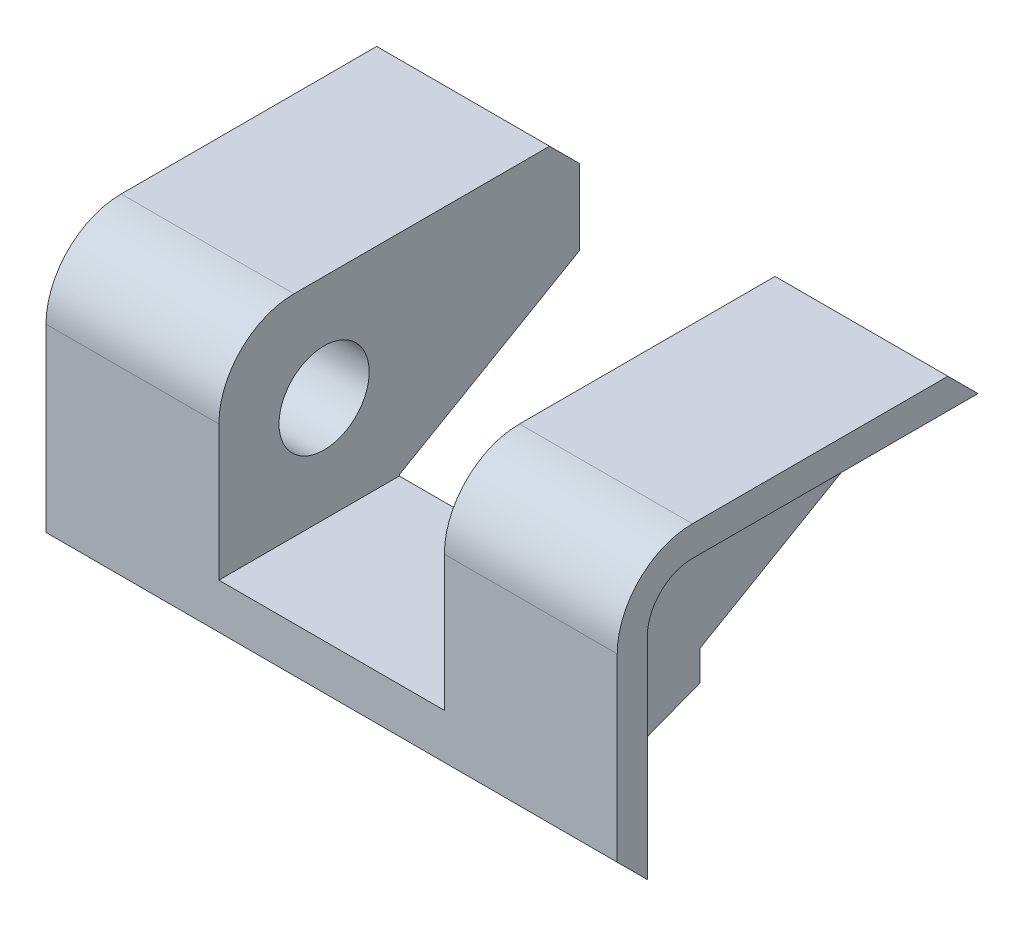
ISO-10303-21;
HEADER;
FILE_DESCRIPTION(('STEP AP214'),'2;1');
FILE_NAME('part.step','',(''),(''),'','','');
FILE_SCHEMA(('AUTOMOTIVE_DESIGN { 1 0 10303 214 1 1 1 1 }'));
ENDSEC;
DATA;
#1=APPLICATION_CONTEXT('core data for automotive mechanical design processes');
#2=APPLICATION_PROTOCOL_DEFINITION('international standard','automotive_design',2000,#1);
#3=PRODUCT_CONTEXT('',#1,'mechanical');
#4=PRODUCT('Part','Part','',(#3));
#5=PRODUCT_RELATED_PRODUCT_CATEGORY('part','',(#4));
#6=PRODUCT_DEFINITION_FORMATION('','',#4);
#7=PRODUCT_DEFINITION_CONTEXT('part definition',#1,'design');
#8=PRODUCT_DEFINITION('design','',#6,#7);
#9=PRODUCT_DEFINITION_SHAPE('','',#8);
#10=(LENGTH_UNIT() NAMED_UNIT(*) SI_UNIT(.MILLI.,.METRE.));
#11=(NAMED_UNIT(*) PLANE_ANGLE_UNIT() SI_UNIT($,.RADIAN.));
#12=(NAMED_UNIT(*) SI_UNIT($,.STERADIAN.) SOLID_ANGLE_UNIT());
#13=UNCERTAINTY_MEASURE_WITH_UNIT(LENGTH_MEASURE(1.E-05),#10,'distance_accuracy_value','');
#14=(GEOMETRIC_REPRESENTATION_CONTEXT(3) GLOBAL_UNCERTAINTY_ASSIGNED_CONTEXT((#13)) GLOBAL_UNIT_ASSIGNED_CONTEXT((#10,
#11,#12)) REPRESENTATION_CONTEXT('',''));
#15=CARTESIAN_POINT('',(0.,0.,0.));
#16=DIRECTION('',(0.,0.,1.));
#17=DIRECTION('',(1.,0.,0.));
#18=AXIS2_PLACEMENT_3D('',#15,#16,#17);
#19=CARTESIAN_POINT('',(-19.,7.,-17.));
#20=DIRECTION('',(0.,0.,1.));
#21=DIRECTION('',(1.,0.,0.));
#22=AXIS2_PLACEMENT_3D('',#19,#20,#21);
#23=PLANE('',#22);
#24=DIRECTION('',(0.,1.,0.));
#25=VECTOR('',#24,1.);
#26=CARTESIAN_POINT('',(-7.5,-7.,-17.));
#27=LINE('',#26,#25);
#28=CARTESIAN_POINT('',(-7.5,0.,-17.));
#29=VERTEX_POINT('',#28);
#30=CARTESIAN_POINT('',(-7.5,5.,-17.));
#31=VERTEX_POINT('',#30);
#32=EDGE_CURVE('E192',#29,#31,#27,.T.);
#33=ORIENTED_EDGE('',*,*,#32,.F.);
#34=DIRECTION('',(1.,0.,0.));
#35=VECTOR('',#34,1.);
#36=CARTESIAN_POINT('',(-19.,0.,-17.));
#37=LINE('',#36,#35);
#38=CARTESIAN_POINT('',(-12.5,0.,-17.));
#39=VERTEX_POINT('',#38);
#40=EDGE_CURVE('E352',#39,#29,#37,.T.);
#41=ORIENTED_EDGE('',*,*,#40,.F.);
#42=DIRECTION('',(0.,-1.,0.));
#43=VECTOR('',#42,1.);
#44=CARTESIAN_POINT('',(-12.5,7.,-17.));
#45=LINE('',#44,#43);
#46=CARTESIAN_POINT('',(-12.5,5.,-17.));
#47=VERTEX_POINT('',#46);
#48=EDGE_CURVE('E305',#47,#39,#45,.T.);
#49=ORIENTED_EDGE('',*,*,#48,.F.);
#50=DIRECTION('',(1.,0.,0.));
#51=VECTOR('',#50,1.);
#52=CARTESIAN_POINT('',(19.,5.,-17.));
#53=LINE('',#52,#51);
#54=EDGE_CURVE('E359',#47,#31,#53,.T.);
#55=ORIENTED_EDGE('',*,*,#54,.T.);
#56=EDGE_LOOP('',(#33,#41,#49,#55));
#57=FACE_BOUND('',#56,.T.);
#58=ADVANCED_FACE('F14',(#57),#23,.F.);
#59=DIRECTION('',(0.,-1.,0.));
#60=VECTOR('',#59,1.);
#61=CARTESIAN_POINT('',(7.5,20.,-17.));
#62=LINE('',#61,#60);
#63=CARTESIAN_POINT('',(7.5,5.,-17.));
#64=VERTEX_POINT('',#63);
#65=CARTESIAN_POINT('',(7.5,0.,-17.));
#66=VERTEX_POINT('',#65);
#67=EDGE_CURVE('E208',#64,#66,#62,.T.);
#68=ORIENTED_EDGE('',*,*,#67,.F.);
#69=CARTESIAN_POINT('',(12.5,5.,-17.));
#70=VERTEX_POINT('',#69);
#71=EDGE_CURVE('E37',#64,#70,#53,.T.);
#72=ORIENTED_EDGE('',*,*,#71,.T.);
#73=DIRECTION('',(0.,1.,0.));
#74=VECTOR('',#73,1.);
#75=CARTESIAN_POINT('',(12.5,7.,-17.));
#76=LINE('',#75,#74);
#77=CARTESIAN_POINT('',(12.5,0.,-17.));
#78=VERTEX_POINT('',#77);
#79=EDGE_CURVE('E272',#78,#70,#76,.T.);
#80=ORIENTED_EDGE('',*,*,#79,.F.);
#81=EDGE_CURVE('E351',#66,#78,#37,.T.);
#82=ORIENTED_EDGE('',*,*,#81,.F.);
#83=EDGE_LOOP('',(#68,#72,#80,#82));
#84=FACE_BOUND('',#83,.T.);
#85=ADVANCED_FACE('F467',(#84),#23,.F.);
#86=CARTESIAN_POINT('',(-19.,0.,-17.));
#87=DIRECTION('',(0.,0.86602540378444,0.5));
#88=DIRECTION('',(0.,0.5,-0.86602540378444));
#89=AXIS2_PLACEMENT_3D('',#86,#87,#88);
#90=PLANE('',#89);
#91=DIRECTION('',(0.,0.5,-0.86602540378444));
#92=VECTOR('',#91,1.);
#93=CARTESIAN_POINT('',(-7.5,0.,-17.));
#94=LINE('',#93,#92);
#95=CARTESIAN_POINT('',(-7.5,-6.92820323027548,-5.));
#96=VERTEX_POINT('',#95);
#97=EDGE_CURVE('E234',#96,#29,#94,.T.);
#98=ORIENTED_EDGE('',*,*,#97,.F.);
#99=DIRECTION('',(1.,0.,0.));
#100=VECTOR('',#99,1.);
#101=CARTESIAN_POINT('',(-19.,-6.92820323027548,-5.));
#102=LINE('',#101,#100);
#103=CARTESIAN_POINT('',(-12.5,-6.92820323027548,-5.));
#104=VERTEX_POINT('',#103);
#105=EDGE_CURVE('E348',#104,#96,#102,.T.);
#106=ORIENTED_EDGE('',*,*,#105,.F.);
#107=DIRECTION('',(0.,-0.5,0.86602540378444));
#108=VECTOR('',#107,1.);
#109=CARTESIAN_POINT('',(-12.5,0.,-17.));
#110=LINE('',#109,#108);
#111=EDGE_CURVE('E303',#39,#104,#110,.T.);
#112=ORIENTED_EDGE('',*,*,#111,.F.);
#113=ORIENTED_EDGE('',*,*,#40,.T.);
#114=EDGE_LOOP('',(#98,#106,#112,#113));
#115=FACE_BOUND('',#114,.T.);
#116=ADVANCED_FACE('F16',(#115),#90,.F.);
#117=DIRECTION('',(0.,-0.5,0.86602540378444));
#118=VECTOR('',#117,1.);
#119=CARTESIAN_POINT('',(7.5,0.,-17.));
#120=LINE('',#119,#118);
#121=CARTESIAN_POINT('',(7.5,-6.92820323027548,-5.));
#122=VERTEX_POINT('',#121);
#123=EDGE_CURVE('E221',#66,#122,#120,.T.);
#124=ORIENTED_EDGE('',*,*,#123,.F.);
#125=ORIENTED_EDGE('',*,*,#81,.T.);
#126=DIRECTION('',(0.,0.5,-0.86602540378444));
#127=VECTOR('',#126,1.);
#128=CARTESIAN_POINT('',(12.5,0.,-17.));
#129=LINE('',#128,#127);
#130=CARTESIAN_POINT('',(12.5,-6.92820323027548,-5.));
#131=VERTEX_POINT('',#130);
#132=EDGE_CURVE('E269',#131,#78,#129,.T.);
#133=ORIENTED_EDGE('',*,*,#132,.F.);
#134=EDGE_CURVE('E347',#122,#131,#102,.T.);
#135=ORIENTED_EDGE('',*,*,#134,.F.);
#136=EDGE_LOOP('',(#124,#125,#133,#135));
#137=FACE_BOUND('',#136,.T.);
#138=ADVANCED_FACE('F496',(#137),#90,.F.);
#139=CARTESIAN_POINT('',(-19.,-6.92820323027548,-5.));
#140=DIRECTION('',(0.,0.,1.));
#141=DIRECTION('',(1.,0.,0.));
#142=AXIS2_PLACEMENT_3D('',#139,#140,#141);
#143=PLANE('',#142);
#144=DIRECTION('',(0.,1.,0.));
#145=VECTOR('',#144,1.);
#146=CARTESIAN_POINT('',(-7.5,-6.92820323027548,-5.));
#147=LINE('',#146,#145);
#148=CARTESIAN_POINT('',(-7.5,-7.,-5.));
#149=VERTEX_POINT('',#148);
#150=EDGE_CURVE('E232',#149,#96,#147,.T.);
#151=ORIENTED_EDGE('',*,*,#150,.F.);
#152=DIRECTION('',(1.,0.,0.));
#153=VECTOR('',#152,1.);
#154=CARTESIAN_POINT('',(-19.,-7.,-5.));
#155=LINE('',#154,#153);
#156=CARTESIAN_POINT('',(7.5,-7.,-5.));
#157=VERTEX_POINT('',#156);
#158=EDGE_CURVE('E236',#149,#157,#155,.T.);
#159=ORIENTED_EDGE('',*,*,#158,.T.);
#160=DIRECTION('',(0.,-1.,0.));
#161=VECTOR('',#160,1.);
#162=CARTESIAN_POINT('',(7.5,-6.92820323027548,-5.));
#163=LINE('',#162,#161);
#164=EDGE_CURVE('E188',#122,#157,#163,.T.);
#165=ORIENTED_EDGE('',*,*,#164,.F.);
#166=ORIENTED_EDGE('',*,*,#134,.T.);
#167=DIRECTION('',(0.,1.,0.));
#168=VECTOR('',#167,1.);
#169=CARTESIAN_POINT('',(12.5,-6.92820323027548,-5.));
#170=LINE('',#169,#168);
#171=CARTESIAN_POINT('',(12.5,-8.92820323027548,-5.));
#172=VERTEX_POINT('',#171);
#173=EDGE_CURVE('E266',#172,#131,#170,.T.);
#174=ORIENTED_EDGE('',*,*,#173,.F.);
#175=DIRECTION('',(1.,0.,0.));
#176=VECTOR('',#175,1.);
#177=CARTESIAN_POINT('',(-19.,-8.92820323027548,-5.));
#178=LINE('',#177,#176);
#179=CARTESIAN_POINT('',(-12.5,-8.92820323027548,-5.));
#180=VERTEX_POINT('',#179);
#181=EDGE_CURVE('E344',#180,#172,#178,.T.);
#182=ORIENTED_EDGE('',*,*,#181,.F.);
#183=DIRECTION('',(0.,-1.,0.));
#184=VECTOR('',#183,1.);
#185=CARTESIAN_POINT('',(-12.5,-6.92820323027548,-5.));
#186=LINE('',#185,#184);
#187=EDGE_CURVE('E301',#104,#180,#186,.T.);
#188=ORIENTED_EDGE('',*,*,#187,.F.);
#189=ORIENTED_EDGE('',*,*,#105,.T.);
#190=EDGE_LOOP('',(#151,#159,#165,#166,#174,#182,#188,#189));
#191=FACE_BOUND('',#190,.T.);
#192=ADVANCED_FACE('F434',(#191),#143,.F.);
#193=CARTESIAN_POINT('',(-19.,0.,0.));
#194=DIRECTION('',(1.,0.,0.));
#195=DIRECTION('',(0.,-1.,0.));
#196=AXIS2_PLACEMENT_3D('',#193,#194,#195);
#197=CYLINDRICAL_SURFACE('',#196,3.);
#198=CARTESIAN_POINT('',(-12.5,0.,0.));
#199=DIRECTION('',(-1.,0.,0.));
#200=DIRECTION('',(0.,1.,0.));
#201=AXIS2_PLACEMENT_3D('',#198,#199,#200);
#202=CIRCLE('',#201,3.);
#203=CARTESIAN_POINT('',(-12.5,3.,0.));
#204=VERTEX_POINT('',#203);
#205=EDGE_CURVE('E293',#204,#204,#202,.T.);
#206=ORIENTED_EDGE('',*,*,#205,.T.);
#207=EDGE_LOOP('',(#206));
#208=FACE_BOUND('',#207,.T.);
#209=CARTESIAN_POINT('',(-7.5,0.,0.));
#210=DIRECTION('',(1.,0.,0.));
#211=DIRECTION('',(0.,-1.,0.));
#212=AXIS2_PLACEMENT_3D('',#209,#210,#211);
#213=CIRCLE('',#212,3.);
#214=CARTESIAN_POINT('',(-7.5,-3.,0.));
#215=VERTEX_POINT('',#214);
#216=EDGE_CURVE('E229',#215,#215,#213,.T.);
#217=ORIENTED_EDGE('',*,*,#216,.T.);
#218=EDGE_LOOP('',(#217));
#219=FACE_BOUND('',#218,.T.);
#220=ADVANCED_FACE('F495',(#208,#219),#197,.F.);
#221=CARTESIAN_POINT('',(12.5,0.,0.));
#222=DIRECTION('',(1.,0.,0.));
#223=DIRECTION('',(0.,-1.,0.));
#224=AXIS2_PLACEMENT_3D('',#221,#222,#223);
#225=CIRCLE('',#224,3.);
#226=CARTESIAN_POINT('',(12.5,-3.,0.));
#227=VERTEX_POINT('',#226);
#228=EDGE_CURVE('E256',#227,#227,#225,.T.);
#229=ORIENTED_EDGE('',*,*,#228,.T.);
#230=EDGE_LOOP('',(#229));
#231=FACE_BOUND('',#230,.T.);
#232=CARTESIAN_POINT('',(7.5,0.,0.));
#233=DIRECTION('',(-1.,0.,0.));
#234=DIRECTION('',(0.,1.,0.));
#235=AXIS2_PLACEMENT_3D('',#232,#233,#234);
#236=CIRCLE('',#235,3.);
#237=CARTESIAN_POINT('',(7.5,3.,0.));
#238=VERTEX_POINT('',#237);
#239=EDGE_CURVE('E217',#238,#238,#236,.T.);
#240=ORIENTED_EDGE('',*,*,#239,.T.);
#241=EDGE_LOOP('',(#240));
#242=FACE_BOUND('',#241,.T.);
#243=ADVANCED_FACE('F481',(#231,#242),#197,.F.);
#244=CARTESIAN_POINT('',(-19.,-12.,7.));
#245=DIRECTION('',(0.,0.,-1.));
#246=DIRECTION('',(0.,-1.,0.));
#247=AXIS2_PLACEMENT_3D('',#244,#245,#246);
#248=PLANE('',#247);
#249=DIRECTION('',(0.,1.,0.));
#250=VECTOR('',#249,1.);
#251=CARTESIAN_POINT('',(-7.5,-7.,7.));
#252=LINE('',#251,#250);
#253=CARTESIAN_POINT('',(-7.5,-7.,7.));
#254=VERTEX_POINT('',#253);
#255=CARTESIAN_POINT('',(-7.5,2.,7.));
#256=VERTEX_POINT('',#255);
#257=EDGE_CURVE('E206',#254,#256,#252,.T.);
#258=ORIENTED_EDGE('',*,*,#257,.T.);
#259=DIRECTION('',(1.,0.,0.));
#260=VECTOR('',#259,1.);
#261=CARTESIAN_POINT('',(-19.,1.99999999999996,7.));
#262=LINE('',#261,#260);
#263=CARTESIAN_POINT('',(-19.,1.99999999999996,7.));
#264=VERTEX_POINT('',#263);
#265=EDGE_CURVE('E330',#264,#256,#262,.T.);
#266=ORIENTED_EDGE('',*,*,#265,.F.);
#267=DIRECTION('',(0.,1.,0.));
#268=VECTOR('',#267,1.);
#269=CARTESIAN_POINT('',(-19.,-12.,7.));
#270=LINE('',#269,#268);
#271=CARTESIAN_POINT('',(-19.,-10.,7.));
#272=VERTEX_POINT('',#271);
#273=EDGE_CURVE('E319',#272,#264,#270,.T.);
#274=ORIENTED_EDGE('',*,*,#273,.F.);
#275=DIRECTION('',(1.,0.,0.));
#276=VECTOR('',#275,1.);
#277=CARTESIAN_POINT('',(19.,-10.,7.));
#278=LINE('',#277,#276);
#279=CARTESIAN_POINT('',(19.,-10.,7.));
#280=VERTEX_POINT('',#279);
#281=EDGE_CURVE('E373',#272,#280,#278,.T.);
#282=ORIENTED_EDGE('',*,*,#281,.T.);
#283=DIRECTION('',(0.,1.,0.));
#284=VECTOR('',#283,1.);
#285=CARTESIAN_POINT('',(19.,-12.,7.));
#286=LINE('',#285,#284);
#287=CARTESIAN_POINT('',(19.,1.99999999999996,7.));
#288=VERTEX_POINT('',#287);
#289=EDGE_CURVE('E309',#280,#288,#286,.T.);
#290=ORIENTED_EDGE('',*,*,#289,.T.);
#291=CARTESIAN_POINT('',(7.5,2.,7.));
#292=VERTEX_POINT('',#291);
#293=EDGE_CURVE('E205',#292,#288,#262,.T.);
#294=ORIENTED_EDGE('',*,*,#293,.F.);
#295=DIRECTION('',(0.,-1.,0.));
#296=VECTOR('',#295,1.);
#297=CARTESIAN_POINT('',(7.5,20.,7.));
#298=LINE('',#297,#296);
#299=CARTESIAN_POINT('',(7.5,-7.,7.));
#300=VERTEX_POINT('',#299);
#301=EDGE_CURVE('E185',#292,#300,#298,.T.);
#302=ORIENTED_EDGE('',*,*,#301,.T.);
#303=DIRECTION('',(1.,0.,0.));
#304=VECTOR('',#303,1.);
#305=CARTESIAN_POINT('',(-7.5,-7.,7.));
#306=LINE('',#305,#304);
#307=EDGE_CURVE('E195',#254,#300,#306,.T.);
#308=ORIENTED_EDGE('',*,*,#307,.F.);
#309=EDGE_LOOP('',(#258,#266,#274,#282,#290,#294,#302,#308));
#310=FACE_BOUND('',#309,.T.);
#311=ADVANCED_FACE('F203',(#310),#248,.F.);
#312=CARTESIAN_POINT('',(-19.,2.,2.));
#313=DIRECTION('',(1.,0.,0.));
#314=DIRECTION('',(0.,-1.,0.));
#315=AXIS2_PLACEMENT_3D('',#312,#313,#314);
#316=CYLINDRICAL_SURFACE('',#315,5.);
#317=ORIENTED_EDGE('',*,*,#265,.T.);
#318=CARTESIAN_POINT('',(-7.5,2.,2.));
#319=DIRECTION('',(1.,0.,0.));
#320=DIRECTION('',(0.,-1.,0.));
#321=AXIS2_PLACEMENT_3D('',#318,#319,#320);
#322=CIRCLE('',#321,5.);
#323=CARTESIAN_POINT('',(-7.5,7.,1.99999999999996));
#324=VERTEX_POINT('',#323);
#325=EDGE_CURVE('E226',#256,#324,#322,.F.);
#326=ORIENTED_EDGE('',*,*,#325,.T.);
#327=DIRECTION('',(1.,0.,0.));
#328=VECTOR('',#327,1.);
#329=CARTESIAN_POINT('',(-19.,7.,1.99999999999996));
#330=LINE('',#329,#328);
#331=CARTESIAN_POINT('',(-19.,7.,1.99999999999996));
#332=VERTEX_POINT('',#331);
#333=EDGE_CURVE('E327',#332,#324,#330,.T.);
#334=ORIENTED_EDGE('',*,*,#333,.F.);
#335=CARTESIAN_POINT('',(-19.,2.,2.));
#336=DIRECTION('',(1.,0.,0.));
#337=DIRECTION('',(0.,-1.,0.));
#338=AXIS2_PLACEMENT_3D('',#335,#336,#337);
#339=CIRCLE('',#338,5.);
#340=EDGE_CURVE('E321',#332,#264,#339,.T.);
#341=ORIENTED_EDGE('',*,*,#340,.T.);
#342=EDGE_LOOP('',(#317,#326,#334,#341));
#343=FACE_BOUND('',#342,.T.);
#344=ADVANCED_FACE('F426',(#343),#316,.T.);
#345=CARTESIAN_POINT('',(7.5,7.,1.99999999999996));
#346=VERTEX_POINT('',#345);
#347=CARTESIAN_POINT('',(19.,7.,1.99999999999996));
#348=VERTEX_POINT('',#347);
#349=EDGE_CURVE('E326',#346,#348,#330,.T.);
#350=ORIENTED_EDGE('',*,*,#349,.F.);
#351=CARTESIAN_POINT('',(7.5,2.,2.));
#352=DIRECTION('',(-1.,0.,0.));
#353=DIRECTION('',(0.,1.,0.));
#354=AXIS2_PLACEMENT_3D('',#351,#352,#353);
#355=CIRCLE('',#354,5.);
#356=EDGE_CURVE('E215',#346,#292,#355,.F.);
#357=ORIENTED_EDGE('',*,*,#356,.T.);
#358=ORIENTED_EDGE('',*,*,#293,.T.);
#359=CARTESIAN_POINT('',(19.,2.,2.));
#360=DIRECTION('',(1.,0.,0.));
#361=DIRECTION('',(0.,-1.,0.));
#362=AXIS2_PLACEMENT_3D('',#359,#360,#361);
#363=CIRCLE('',#362,5.);
#364=EDGE_CURVE('E311',#348,#288,#363,.T.);
#365=ORIENTED_EDGE('',*,*,#364,.F.);
#366=EDGE_LOOP('',(#350,#357,#358,#365));
#367=FACE_BOUND('',#366,.T.);
#368=ADVANCED_FACE('F392',(#367),#316,.T.);
#369=CARTESIAN_POINT('',(-19.,7.,-17.));
#370=DIRECTION('',(0.,1.,0.));
#371=DIRECTION('',(0.,0.,-1.));
#372=AXIS2_PLACEMENT_3D('',#369,#370,#371);
#373=PLANE('',#372);
#374=ORIENTED_EDGE('',*,*,#333,.T.);
#375=DIRECTION('',(0.,0.,-1.));
#376=VECTOR('',#375,1.);
#377=CARTESIAN_POINT('',(-7.5,7.,-17.));
#378=LINE('',#377,#376);
#379=CARTESIAN_POINT('',(-7.5,7.,-15.));
#380=VERTEX_POINT('',#379);
#381=EDGE_CURVE('E223',#324,#380,#378,.T.);
#382=ORIENTED_EDGE('',*,*,#381,.T.);
#383=DIRECTION('',(-1.,0.,0.));
#384=VECTOR('',#383,1.);
#385=CARTESIAN_POINT('',(-19.,7.,-15.));
#386=LINE('',#385,#384);
#387=CARTESIAN_POINT('',(-19.,7.,-15.));
#388=VERTEX_POINT('',#387);
#389=EDGE_CURVE('E364',#380,#388,#386,.T.);
#390=ORIENTED_EDGE('',*,*,#389,.T.);
#391=DIRECTION('',(0.,0.,1.));
#392=VECTOR('',#391,1.);
#393=CARTESIAN_POINT('',(-19.,7.,-17.));
#394=LINE('',#393,#392);
#395=EDGE_CURVE('E324',#388,#332,#394,.T.);
#396=ORIENTED_EDGE('',*,*,#395,.T.);
#397=EDGE_LOOP('',(#374,#382,#390,#396));
#398=FACE_BOUND('',#397,.T.);
#399=ADVANCED_FACE('F421',(#398),#373,.T.);
#400=CARTESIAN_POINT('',(19.,7.,-15.));
#401=VERTEX_POINT('',#400);
#402=CARTESIAN_POINT('',(7.5,7.,-15.));
#403=VERTEX_POINT('',#402);
#404=EDGE_CURVE('E365',#401,#403,#386,.T.);
#405=ORIENTED_EDGE('',*,*,#404,.T.);
#406=DIRECTION('',(0.,0.,1.));
#407=VECTOR('',#406,1.);
#408=CARTESIAN_POINT('',(7.5,7.,-17.));
#409=LINE('',#408,#407);
#410=EDGE_CURVE('E29',#403,#346,#409,.T.);
#411=ORIENTED_EDGE('',*,*,#410,.T.);
#412=ORIENTED_EDGE('',*,*,#349,.T.);
#413=DIRECTION('',(0.,0.,1.));
#414=VECTOR('',#413,1.);
#415=CARTESIAN_POINT('',(19.,7.,-17.));
#416=LINE('',#415,#414);
#417=EDGE_CURVE('E314',#401,#348,#416,.T.);
#418=ORIENTED_EDGE('',*,*,#417,.F.);
#419=EDGE_LOOP('',(#405,#411,#412,#418));
#420=FACE_BOUND('',#419,.T.);
#421=ADVANCED_FACE('F384',(#420),#373,.T.);
#422=CARTESIAN_POINT('',(-19.,5.,-17.));
#423=DIRECTION('',(0.,0.707106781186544,-0.707106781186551));
#424=DIRECTION('',(0.,-0.707106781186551,-0.707106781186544));
#425=AXIS2_PLACEMENT_3D('',#422,#423,#424);
#426=PLANE('',#425);
#427=ORIENTED_EDGE('',*,*,#389,.F.);
#428=DIRECTION('',(0.,-0.707106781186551,-0.707106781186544));
#429=VECTOR('',#428,1.);
#430=CARTESIAN_POINT('',(-7.5,5.,-17.));
#431=LINE('',#430,#429);
#432=EDGE_CURVE('E9',#380,#31,#431,.T.);
#433=ORIENTED_EDGE('',*,*,#432,.T.);
#434=ORIENTED_EDGE('',*,*,#54,.F.);
#435=CARTESIAN_POINT('',(-19.,5.,-17.));
#436=VERTEX_POINT('',#435);
#437=EDGE_CURVE('E356',#436,#47,#53,.T.);
#438=ORIENTED_EDGE('',*,*,#437,.F.);
#439=DIRECTION('',(0.,-0.707106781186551,-0.707106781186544));
#440=VECTOR('',#439,1.);
#441=CARTESIAN_POINT('',(-19.,5.,-17.));
#442=LINE('',#441,#440);
#443=EDGE_CURVE('E370',#388,#436,#442,.T.);
#444=ORIENTED_EDGE('',*,*,#443,.F.);
#445=EDGE_LOOP('',(#427,#433,#434,#438,#444));
#446=FACE_BOUND('',#445,.T.);
#447=ADVANCED_FACE('F416',(#446),#426,.T.);
#448=ORIENTED_EDGE('',*,*,#71,.F.);
#449=DIRECTION('',(0.,0.707106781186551,0.707106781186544));
#450=VECTOR('',#449,1.);
#451=CARTESIAN_POINT('',(7.5,5.,-17.));
#452=LINE('',#451,#450);
#453=EDGE_CURVE('E22',#64,#403,#452,.T.);
#454=ORIENTED_EDGE('',*,*,#453,.T.);
#455=ORIENTED_EDGE('',*,*,#404,.F.);
#456=DIRECTION('',(0.,0.707106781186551,0.707106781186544));
#457=VECTOR('',#456,1.);
#458=CARTESIAN_POINT('',(19.,13.,-9.));
#459=LINE('',#458,#457);
#460=CARTESIAN_POINT('',(19.,5.,-17.));
#461=VERTEX_POINT('',#460);
#462=EDGE_CURVE('E362',#461,#401,#459,.T.);
#463=ORIENTED_EDGE('',*,*,#462,.F.);
#464=EDGE_CURVE('E355',#70,#461,#53,.T.);
#465=ORIENTED_EDGE('',*,*,#464,.F.);
#466=EDGE_LOOP('',(#448,#454,#455,#463,#465));
#467=FACE_BOUND('',#466,.T.);
#468=ADVANCED_FACE('F379',(#467),#426,.T.);
#469=CARTESIAN_POINT('',(-19.,-8.92820323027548,-5.));
#470=DIRECTION('',(0.,0.933580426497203,0.358367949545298));
#471=DIRECTION('',(0.,0.358367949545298,-0.933580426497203));
#472=AXIS2_PLACEMENT_3D('',#469,#470,#471);
#473=PLANE('',#472);
#474=DIRECTION('',(0.,0.358367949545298,-0.933580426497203));
#475=VECTOR('',#474,1.);
#476=CARTESIAN_POINT('',(12.5,-8.92820323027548,-5.));
#477=LINE('',#476,#475);
#478=CARTESIAN_POINT('',(12.5,-12.,3.00230417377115));
#479=VERTEX_POINT('',#478);
#480=EDGE_CURVE('E264',#479,#172,#477,.T.);
#481=ORIENTED_EDGE('',*,*,#480,.F.);
#482=DIRECTION('',(1.,0.,0.));
#483=VECTOR('',#482,1.);
#484=CARTESIAN_POINT('',(-19.,-12.,3.00230417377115));
#485=LINE('',#484,#483);
#486=CARTESIAN_POINT('',(-12.5,-12.,3.00230417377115));
#487=VERTEX_POINT('',#486);
#488=EDGE_CURVE('E341',#487,#479,#485,.T.);
#489=ORIENTED_EDGE('',*,*,#488,.F.);
#490=DIRECTION('',(0.,-0.358367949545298,0.933580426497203));
#491=VECTOR('',#490,1.);
#492=CARTESIAN_POINT('',(-12.5,-8.92820323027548,-5.));
#493=LINE('',#492,#491);
#494=EDGE_CURVE('E299',#180,#487,#493,.T.);
#495=ORIENTED_EDGE('',*,*,#494,.F.);
#496=ORIENTED_EDGE('',*,*,#181,.T.);
#497=EDGE_LOOP('',(#481,#489,#495,#496));
#498=FACE_BOUND('',#497,.T.);
#499=ADVANCED_FACE('F490',(#498),#473,.F.);
#500=CARTESIAN_POINT('',(-19.,-7.99911484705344,3.00230417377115));
#501=DIRECTION('',(0.,0.,1.));
#502=DIRECTION('',(0.,1.,0.));
#503=AXIS2_PLACEMENT_3D('',#500,#501,#502);
#504=PLANE('',#503);
#505=ORIENTED_EDGE('',*,*,#488,.T.);
#506=DIRECTION('',(0.,1.,0.));
#507=VECTOR('',#506,1.);
#508=CARTESIAN_POINT('',(12.5,-7.99911484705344,3.00230417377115));
#509=LINE('',#508,#507);
#510=CARTESIAN_POINT('',(12.5,-7.99911484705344,3.00230417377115));
#511=VERTEX_POINT('',#510);
#512=EDGE_CURVE('E261',#479,#511,#509,.T.);
#513=ORIENTED_EDGE('',*,*,#512,.T.);
#514=DIRECTION('',(1.,0.,0.));
#515=VECTOR('',#514,1.);
#516=CARTESIAN_POINT('',(-19.,-7.99911484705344,3.00230417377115));
#517=LINE('',#516,#515);
#518=CARTESIAN_POINT('',(-12.5,-7.99911484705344,3.00230417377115));
#519=VERTEX_POINT('',#518);
#520=EDGE_CURVE('E338',#519,#511,#517,.T.);
#521=ORIENTED_EDGE('',*,*,#520,.F.);
#522=DIRECTION('',(0.,-1.,0.));
#523=VECTOR('',#522,1.);
#524=CARTESIAN_POINT('',(-12.5,-7.99911484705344,3.00230417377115));
#525=LINE('',#524,#523);
#526=EDGE_CURVE('E296',#519,#487,#525,.T.);
#527=ORIENTED_EDGE('',*,*,#526,.T.);
#528=EDGE_LOOP('',(#505,#513,#521,#527));
#529=FACE_BOUND('',#528,.T.);
#530=ADVANCED_FACE('F486',(#529),#504,.T.);
#531=CARTESIAN_POINT('',(-19.,-7.99911484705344,3.00230417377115));
#532=DIRECTION('',(0.,0.999999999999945,3.32135314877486E-07));
#533=DIRECTION('',(0.,3.32135314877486E-07,-0.999999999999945));
#534=AXIS2_PLACEMENT_3D('',#531,#532,#533);
#535=PLANE('',#534);
#536=DIRECTION('',(0.,3.32135314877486E-07,-0.999999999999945));
#537=VECTOR('',#536,1.);
#538=CARTESIAN_POINT('',(12.5,-7.99911484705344,3.00230417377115));
#539=LINE('',#538,#537);
#540=CARTESIAN_POINT('',(12.5,-7.99911551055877,5.));
#541=VERTEX_POINT('',#540);
#542=EDGE_CURVE('E259',#541,#511,#539,.T.);
#543=ORIENTED_EDGE('',*,*,#542,.F.);
#544=DIRECTION('',(1.,0.,0.));
#545=VECTOR('',#544,1.);
#546=CARTESIAN_POINT('',(-19.,-7.99911551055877,5.));
#547=LINE('',#546,#545);
#548=CARTESIAN_POINT('',(-12.5,-7.99911551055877,5.));
#549=VERTEX_POINT('',#548);
#550=EDGE_CURVE('E335',#549,#541,#547,.T.);
#551=ORIENTED_EDGE('',*,*,#550,.F.);
#552=DIRECTION('',(0.,-3.32135314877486E-07,0.999999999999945));
#553=VECTOR('',#552,1.);
#554=CARTESIAN_POINT('',(-12.5,-7.99911484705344,3.00230417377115));
#555=LINE('',#554,#553);
#556=EDGE_CURVE('E294',#519,#549,#555,.T.);
#557=ORIENTED_EDGE('',*,*,#556,.F.);
#558=ORIENTED_EDGE('',*,*,#520,.T.);
#559=EDGE_LOOP('',(#543,#551,#557,#558));
#560=FACE_BOUND('',#559,.T.);
#561=ADVANCED_FACE('F483',(#560),#535,.F.);
#562=CARTESIAN_POINT('',(19.,2.,2.));
#563=DIRECTION('',(1.,0.,0.));
#564=DIRECTION('',(0.,-1.,0.));
#565=AXIS2_PLACEMENT_3D('',#562,#563,#564);
#566=PLANE('',#565);
#567=DIRECTION('',(0.,1.,0.));
#568=VECTOR('',#567,1.);
#569=CARTESIAN_POINT('',(19.,-12.,5.));
#570=LINE('',#569,#568);
#571=CARTESIAN_POINT('',(19.,-12.,5.));
#572=VERTEX_POINT('',#571);
#573=CARTESIAN_POINT('',(19.,1.99999999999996,5.));
#574=VERTEX_POINT('',#573);
#575=EDGE_CURVE('E307',#572,#574,#570,.T.);
#576=ORIENTED_EDGE('',*,*,#575,.T.);
#577=CARTESIAN_POINT('',(19.,2.,2.));
#578=DIRECTION('',(-1.,0.,0.));
#579=DIRECTION('',(0.,1.,0.));
#580=AXIS2_PLACEMENT_3D('',#577,#578,#579);
#581=CIRCLE('',#580,3.);
#582=CARTESIAN_POINT('',(19.,5.,2.));
#583=VERTEX_POINT('',#582);
#584=EDGE_CURVE('E240',#574,#583,#581,.T.);
#585=ORIENTED_EDGE('',*,*,#584,.T.);
#586=DIRECTION('',(0.,0.,1.));
#587=VECTOR('',#586,1.);
#588=CARTESIAN_POINT('',(19.,5.,-20.));
#589=LINE('',#588,#587);
#590=EDGE_CURVE('E238',#461,#583,#589,.T.);
#591=ORIENTED_EDGE('',*,*,#590,.F.);
#592=ORIENTED_EDGE('',*,*,#462,.T.);
#593=ORIENTED_EDGE('',*,*,#417,.T.);
#594=ORIENTED_EDGE('',*,*,#364,.T.);
#595=ORIENTED_EDGE('',*,*,#289,.F.);
#596=DIRECTION('',(0.,-0.707106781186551,-0.707106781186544));
#597=VECTOR('',#596,1.);
#598=CARTESIAN_POINT('',(19.,-6.49999999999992,10.5));
#599=LINE('',#598,#597);
#600=EDGE_CURVE('E358',#280,#572,#599,.T.);
#601=ORIENTED_EDGE('',*,*,#600,.T.);
#602=EDGE_LOOP('',(#576,#585,#591,#592,#593,#594,#595,#601));
#603=FACE_BOUND('',#602,.T.);
#604=ADVANCED_FACE('F388',(#603),#566,.T.);
#605=CARTESIAN_POINT('',(-19.,2.,2.));
#606=DIRECTION('',(1.,0.,0.));
#607=DIRECTION('',(0.,-1.,0.));
#608=AXIS2_PLACEMENT_3D('',#605,#606,#607);
#609=PLANE('',#608);
#610=DIRECTION('',(0.,0.,1.));
#611=VECTOR('',#610,1.);
#612=CARTESIAN_POINT('',(-19.,5.,-20.));
#613=LINE('',#612,#611);
#614=CARTESIAN_POINT('',(-19.,5.,2.));
#615=VERTEX_POINT('',#614);
#616=EDGE_CURVE('E278',#436,#615,#613,.T.);
#617=ORIENTED_EDGE('',*,*,#616,.T.);
#618=CARTESIAN_POINT('',(-19.,2.,2.));
#619=DIRECTION('',(-1.,0.,0.));
#620=DIRECTION('',(0.,1.,0.));
#621=AXIS2_PLACEMENT_3D('',#618,#619,#620);
#622=CIRCLE('',#621,3.);
#623=CARTESIAN_POINT('',(-19.,1.99999999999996,5.));
#624=VERTEX_POINT('',#623);
#625=EDGE_CURVE('E275',#624,#615,#622,.T.);
#626=ORIENTED_EDGE('',*,*,#625,.F.);
#627=DIRECTION('',(0.,1.,0.));
#628=VECTOR('',#627,1.);
#629=CARTESIAN_POINT('',(-19.,-12.,5.));
#630=LINE('',#629,#628);
#631=CARTESIAN_POINT('',(-19.,-12.,5.));
#632=VERTEX_POINT('',#631);
#633=EDGE_CURVE('E317',#632,#624,#630,.T.);
#634=ORIENTED_EDGE('',*,*,#633,.F.);
#635=DIRECTION('',(0.,0.707106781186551,0.707106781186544));
#636=VECTOR('',#635,1.);
#637=CARTESIAN_POINT('',(-19.,-10.,7.));
#638=LINE('',#637,#636);
#639=EDGE_CURVE('E368',#632,#272,#638,.T.);
#640=ORIENTED_EDGE('',*,*,#639,.T.);
#641=ORIENTED_EDGE('',*,*,#273,.T.);
#642=ORIENTED_EDGE('',*,*,#340,.F.);
#643=ORIENTED_EDGE('',*,*,#395,.F.);
#644=ORIENTED_EDGE('',*,*,#443,.T.);
#645=EDGE_LOOP('',(#617,#626,#634,#640,#641,#642,#643,#644));
#646=FACE_BOUND('',#645,.T.);
#647=ADVANCED_FACE('F428',(#646),#609,.F.);
#648=CARTESIAN_POINT('',(-19.,-12.,5.));
#649=DIRECTION('',(0.,0.,-1.));
#650=DIRECTION('',(-1.,0.,0.));
#651=AXIS2_PLACEMENT_3D('',#648,#649,#650);
#652=PLANE('',#651);
#653=ORIENTED_EDGE('',*,*,#575,.F.);
#654=DIRECTION('',(1.,0.,0.));
#655=VECTOR('',#654,1.);
#656=CARTESIAN_POINT('',(-19.,-12.,5.));
#657=LINE('',#656,#655);
#658=EDGE_CURVE('E333',#632,#572,#657,.T.);
#659=ORIENTED_EDGE('',*,*,#658,.F.);
#660=ORIENTED_EDGE('',*,*,#633,.T.);
#661=DIRECTION('',(-1.,0.,0.));
#662=VECTOR('',#661,1.);
#663=CARTESIAN_POINT('',(-12.5,1.99999999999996,5.));
#664=LINE('',#663,#662);
#665=CARTESIAN_POINT('',(-12.5,1.99999999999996,5.));
#666=VERTEX_POINT('',#665);
#667=EDGE_CURVE('E288',#666,#624,#664,.T.);
#668=ORIENTED_EDGE('',*,*,#667,.F.);
#669=DIRECTION('',(0.,1.,0.));
#670=VECTOR('',#669,1.);
#671=CARTESIAN_POINT('',(-12.5,-20.,5.));
#672=LINE('',#671,#670);
#673=EDGE_CURVE('E281',#549,#666,#672,.T.);
#674=ORIENTED_EDGE('',*,*,#673,.F.);
#675=ORIENTED_EDGE('',*,*,#550,.T.);
#676=DIRECTION('',(0.,1.,0.));
#677=VECTOR('',#676,1.);
#678=CARTESIAN_POINT('',(12.5,-20.,5.));
#679=LINE('',#678,#677);
#680=CARTESIAN_POINT('',(12.5,1.99999999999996,5.));
#681=VERTEX_POINT('',#680);
#682=EDGE_CURVE('E248',#541,#681,#679,.T.);
#683=ORIENTED_EDGE('',*,*,#682,.T.);
#684=DIRECTION('',(1.,0.,0.));
#685=VECTOR('',#684,1.);
#686=CARTESIAN_POINT('',(12.5,1.99999999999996,5.));
#687=LINE('',#686,#685);
#688=EDGE_CURVE('E253',#681,#574,#687,.T.);
#689=ORIENTED_EDGE('',*,*,#688,.T.);
#690=EDGE_LOOP('',(#653,#659,#660,#668,#674,#675,#683,#689));
#691=FACE_BOUND('',#690,.T.);
#692=ADVANCED_FACE('F398',(#691),#652,.T.);
#693=CARTESIAN_POINT('',(-19.,-10.,7.));
#694=DIRECTION('',(0.,-0.707106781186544,0.707106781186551));
#695=DIRECTION('',(0.,0.707106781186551,0.707106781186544));
#696=AXIS2_PLACEMENT_3D('',#693,#694,#695);
#697=PLANE('',#696);
#698=ORIENTED_EDGE('',*,*,#639,.F.);
#699=ORIENTED_EDGE('',*,*,#658,.T.);
#700=ORIENTED_EDGE('',*,*,#600,.F.);
#701=ORIENTED_EDGE('',*,*,#281,.F.);
#702=EDGE_LOOP('',(#698,#699,#700,#701));
#703=FACE_BOUND('',#702,.T.);
#704=ADVANCED_FACE('F452',(#703),#697,.T.);
#705=CARTESIAN_POINT('',(-12.5,2.,2.));
#706=DIRECTION('',(-1.,0.,0.));
#707=DIRECTION('',(0.,1.,0.));
#708=AXIS2_PLACEMENT_3D('',#705,#706,#707);
#709=PLANE('',#708);
#710=ORIENTED_EDGE('',*,*,#205,.F.);
#711=EDGE_LOOP('',(#710));
#712=FACE_BOUND('',#711,.T.);
#713=ORIENTED_EDGE('',*,*,#48,.T.);
#714=ORIENTED_EDGE('',*,*,#111,.T.);
#715=ORIENTED_EDGE('',*,*,#187,.T.);
#716=ORIENTED_EDGE('',*,*,#494,.T.);
#717=ORIENTED_EDGE('',*,*,#526,.F.);
#718=ORIENTED_EDGE('',*,*,#556,.T.);
#719=ORIENTED_EDGE('',*,*,#673,.T.);
#720=CARTESIAN_POINT('',(-12.5,2.,2.));
#721=DIRECTION('',(-1.,0.,0.));
#722=DIRECTION('',(0.,1.,0.));
#723=AXIS2_PLACEMENT_3D('',#720,#721,#722);
#724=CIRCLE('',#723,3.);
#725=CARTESIAN_POINT('',(-12.5,5.,2.));
#726=VERTEX_POINT('',#725);
#727=EDGE_CURVE('E283',#666,#726,#724,.T.);
#728=ORIENTED_EDGE('',*,*,#727,.T.);
#729=DIRECTION('',(0.,0.,1.));
#730=VECTOR('',#729,1.);
#731=CARTESIAN_POINT('',(-12.5,5.,-20.));
#732=LINE('',#731,#730);
#733=EDGE_CURVE('E286',#47,#726,#732,.T.);
#734=ORIENTED_EDGE('',*,*,#733,.F.);
#735=EDGE_LOOP('',(#713,#714,#715,#716,#717,#718,#719,#728,#734));
#736=FACE_BOUND('',#735,.T.);
#737=ADVANCED_FACE('F441',(#712,#736),#709,.T.);
#738=CARTESIAN_POINT('',(-12.5,5.,-20.));
#739=DIRECTION('',(0.,-1.,0.));
#740=DIRECTION('',(0.,0.,1.));
#741=AXIS2_PLACEMENT_3D('',#738,#739,#740);
#742=PLANE('',#741);
#743=ORIENTED_EDGE('',*,*,#733,.T.);
#744=DIRECTION('',(-1.,0.,0.));
#745=VECTOR('',#744,1.);
#746=CARTESIAN_POINT('',(-12.5,5.,2.));
#747=LINE('',#746,#745);
#748=EDGE_CURVE('E291',#726,#615,#747,.T.);
#749=ORIENTED_EDGE('',*,*,#748,.T.);
#750=ORIENTED_EDGE('',*,*,#616,.F.);
#751=ORIENTED_EDGE('',*,*,#437,.T.);
#752=EDGE_LOOP('',(#743,#749,#750,#751));
#753=FACE_BOUND('',#752,.T.);
#754=ADVANCED_FACE('F447',(#753),#742,.T.);
#755=CARTESIAN_POINT('',(-12.5,2.,2.));
#756=DIRECTION('',(-1.,0.,0.));
#757=DIRECTION('',(0.,1.,0.));
#758=AXIS2_PLACEMENT_3D('',#755,#756,#757);
#759=CYLINDRICAL_SURFACE('',#758,3.);
#760=ORIENTED_EDGE('',*,*,#667,.T.);
#761=ORIENTED_EDGE('',*,*,#625,.T.);
#762=ORIENTED_EDGE('',*,*,#748,.F.);
#763=ORIENTED_EDGE('',*,*,#727,.F.);
#764=EDGE_LOOP('',(#760,#761,#762,#763));
#765=FACE_BOUND('',#764,.T.);
#766=ADVANCED_FACE('F449',(#765),#759,.F.);
#767=CARTESIAN_POINT('',(12.5,2.,2.));
#768=DIRECTION('',(1.,0.,0.));
#769=DIRECTION('',(0.,1.,0.));
#770=AXIS2_PLACEMENT_3D('',#767,#768,#769);
#771=PLANE('',#770);
#772=ORIENTED_EDGE('',*,*,#228,.F.);
#773=EDGE_LOOP('',(#772));
#774=FACE_BOUND('',#773,.T.);
#775=ORIENTED_EDGE('',*,*,#79,.T.);
#776=DIRECTION('',(0.,0.,1.));
#777=VECTOR('',#776,1.);
#778=CARTESIAN_POINT('',(12.5,5.,-20.));
#779=LINE('',#778,#777);
#780=CARTESIAN_POINT('',(12.5,5.,2.));
#781=VERTEX_POINT('',#780);
#782=EDGE_CURVE('E243',#70,#781,#779,.T.);
#783=ORIENTED_EDGE('',*,*,#782,.T.);
#784=CARTESIAN_POINT('',(12.5,2.,2.));
#785=DIRECTION('',(-1.,0.,0.));
#786=DIRECTION('',(0.,1.,0.));
#787=AXIS2_PLACEMENT_3D('',#784,#785,#786);
#788=CIRCLE('',#787,3.);
#789=EDGE_CURVE('E245',#681,#781,#788,.T.);
#790=ORIENTED_EDGE('',*,*,#789,.F.);
#791=ORIENTED_EDGE('',*,*,#682,.F.);
#792=ORIENTED_EDGE('',*,*,#542,.T.);
#793=ORIENTED_EDGE('',*,*,#512,.F.);
#794=ORIENTED_EDGE('',*,*,#480,.T.);
#795=ORIENTED_EDGE('',*,*,#173,.T.);
#796=ORIENTED_EDGE('',*,*,#132,.T.);
#797=EDGE_LOOP('',(#775,#783,#790,#791,#792,#793,#794,#795,#796));
#798=FACE_BOUND('',#797,.T.);
#799=ADVANCED_FACE('F514',(#774,#798),#771,.T.);
#800=CARTESIAN_POINT('',(12.5,2.,2.));
#801=DIRECTION('',(1.,0.,0.));
#802=DIRECTION('',(0.,-1.,0.));
#803=AXIS2_PLACEMENT_3D('',#800,#801,#802);
#804=CYLINDRICAL_SURFACE('',#803,3.);
#805=DIRECTION('',(1.,0.,0.));
#806=VECTOR('',#805,1.);
#807=CARTESIAN_POINT('',(12.5,5.,2.));
#808=LINE('',#807,#806);
#809=EDGE_CURVE('E250',#781,#583,#808,.T.);
#810=ORIENTED_EDGE('',*,*,#809,.T.);
#811=ORIENTED_EDGE('',*,*,#584,.F.);
#812=ORIENTED_EDGE('',*,*,#688,.F.);
#813=ORIENTED_EDGE('',*,*,#789,.T.);
#814=EDGE_LOOP('',(#810,#811,#812,#813));
#815=FACE_BOUND('',#814,.T.);
#816=ADVANCED_FACE('F404',(#815),#804,.F.);
#817=CARTESIAN_POINT('',(12.5,5.,-20.));
#818=DIRECTION('',(0.,1.,0.));
#819=DIRECTION('',(0.,0.,-1.));
#820=AXIS2_PLACEMENT_3D('',#817,#818,#819);
#821=PLANE('',#820);
#822=ORIENTED_EDGE('',*,*,#464,.T.);
#823=ORIENTED_EDGE('',*,*,#590,.T.);
#824=ORIENTED_EDGE('',*,*,#809,.F.);
#825=ORIENTED_EDGE('',*,*,#782,.F.);
#826=EDGE_LOOP('',(#822,#823,#824,#825));
#827=FACE_BOUND('',#826,.T.);
#828=ADVANCED_FACE('F523',(#827),#821,.F.);
#829=CARTESIAN_POINT('',(-7.5,-7.,-17.));
#830=DIRECTION('',(0.,-1.,0.));
#831=DIRECTION('',(-1.,0.,0.));
#832=AXIS2_PLACEMENT_3D('',#829,#830,#831);
#833=PLANE('',#832);
#834=DIRECTION('',(0.,0.,1.));
#835=VECTOR('',#834,1.);
#836=CARTESIAN_POINT('',(-7.5,-7.,-17.));
#837=LINE('',#836,#835);
#838=EDGE_CURVE('E191',#149,#254,#837,.T.);
#839=ORIENTED_EDGE('',*,*,#838,.T.);
#840=ORIENTED_EDGE('',*,*,#307,.T.);
#841=DIRECTION('',(0.,0.,1.));
#842=VECTOR('',#841,1.);
#843=CARTESIAN_POINT('',(7.5,-7.,-17.));
#844=LINE('',#843,#842);
#845=EDGE_CURVE('E181',#157,#300,#844,.T.);
#846=ORIENTED_EDGE('',*,*,#845,.F.);
#847=ORIENTED_EDGE('',*,*,#158,.F.);
#848=EDGE_LOOP('',(#839,#840,#846,#847));
#849=FACE_BOUND('',#848,.T.);
#850=ADVANCED_FACE('F196',(#849),#833,.F.);
#851=CARTESIAN_POINT('',(-7.5,-7.,-17.));
#852=DIRECTION('',(1.,0.,0.));
#853=DIRECTION('',(0.,-1.,0.));
#854=AXIS2_PLACEMENT_3D('',#851,#852,#853);
#855=PLANE('',#854);
#856=ORIENTED_EDGE('',*,*,#216,.F.);
#857=EDGE_LOOP('',(#856));
#858=FACE_BOUND('',#857,.T.);
#859=ORIENTED_EDGE('',*,*,#97,.T.);
#860=ORIENTED_EDGE('',*,*,#32,.T.);
#861=ORIENTED_EDGE('',*,*,#432,.F.);
#862=ORIENTED_EDGE('',*,*,#381,.F.);
#863=ORIENTED_EDGE('',*,*,#325,.F.);
#864=ORIENTED_EDGE('',*,*,#257,.F.);
#865=ORIENTED_EDGE('',*,*,#838,.F.);
#866=ORIENTED_EDGE('',*,*,#150,.T.);
#867=EDGE_LOOP('',(#859,#860,#861,#862,#863,#864,#865,#866));
#868=FACE_BOUND('',#867,.T.);
#869=ADVANCED_FACE('F419',(#858,#868),#855,.T.);
#870=CARTESIAN_POINT('',(7.5,20.,-17.));
#871=DIRECTION('',(-1.,0.,0.));
#872=DIRECTION('',(0.,1.,0.));
#873=AXIS2_PLACEMENT_3D('',#870,#871,#872);
#874=PLANE('',#873);
#875=ORIENTED_EDGE('',*,*,#239,.F.);
#876=EDGE_LOOP('',(#875));
#877=FACE_BOUND('',#876,.T.);
#878=ORIENTED_EDGE('',*,*,#123,.T.);
#879=ORIENTED_EDGE('',*,*,#164,.T.);
#880=ORIENTED_EDGE('',*,*,#845,.T.);
#881=ORIENTED_EDGE('',*,*,#301,.F.);
#882=ORIENTED_EDGE('',*,*,#356,.F.);
#883=ORIENTED_EDGE('',*,*,#410,.F.);
#884=ORIENTED_EDGE('',*,*,#453,.F.);
#885=ORIENTED_EDGE('',*,*,#67,.T.);
#886=EDGE_LOOP('',(#878,#879,#880,#881,#882,#883,#884,#885));
#887=FACE_BOUND('',#886,.T.);
#888=ADVANCED_FACE('F183',(#877,#887),#874,.T.);
#889=CLOSED_SHELL('',(#58,#85,#116,#138,#192,#220,#243,#311,#344,#368,#399,#421,#447,#468,#499,
#530,#561,#604,#647,#692,#704,#737,#754,#766,#799,#816,#828,#850,#869,#888));
#890=MANIFOLD_SOLID_BREP('B1',#889);
#891=ADVANCED_BREP_SHAPE_REPRESENTATION('',(#18,#890),#14);
#892=SHAPE_DEFINITION_REPRESENTATION(#9,#891);
ENDSEC;
END-ISO-10303-21;
